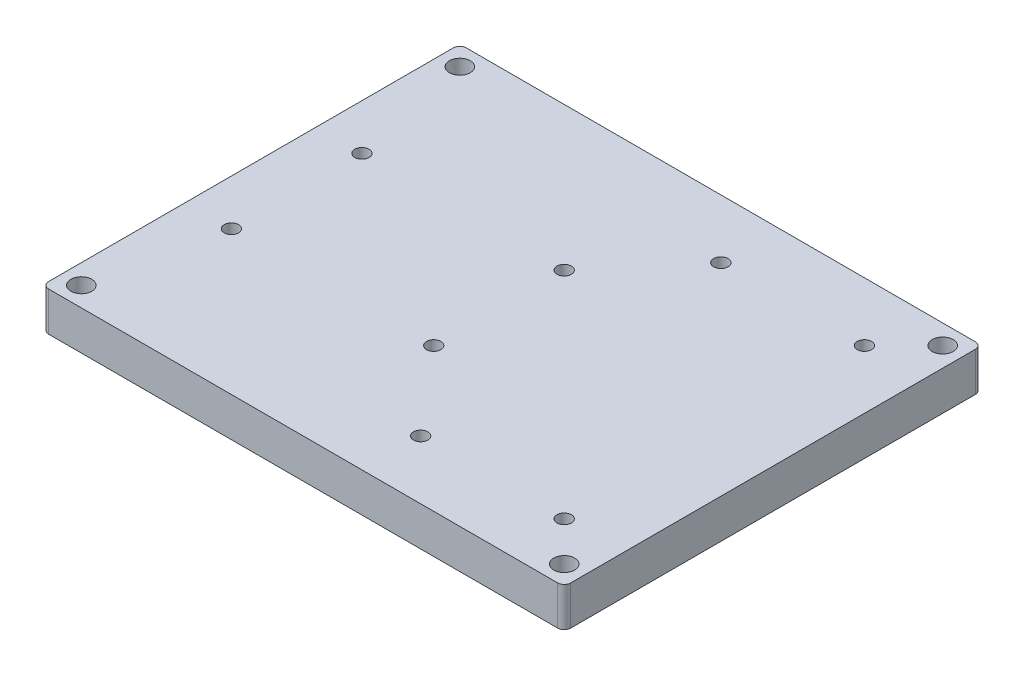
ISO-10303-21;
HEADER;
FILE_DESCRIPTION(('STEP AP214'),'2;1');
FILE_NAME('part.step','',(''),(''),'','','');
FILE_SCHEMA(('AUTOMOTIVE_DESIGN { 1 0 10303 214 1 1 1 1 }'));
ENDSEC;
DATA;
#1=APPLICATION_CONTEXT('core data for automotive mechanical design processes');
#2=APPLICATION_PROTOCOL_DEFINITION('international standard','automotive_design',2000,#1);
#3=PRODUCT_CONTEXT('',#1,'mechanical');
#4=PRODUCT('Part','Part','',(#3));
#5=PRODUCT_RELATED_PRODUCT_CATEGORY('part','',(#4));
#6=PRODUCT_DEFINITION_FORMATION('','',#4);
#7=PRODUCT_DEFINITION_CONTEXT('part definition',#1,'design');
#8=PRODUCT_DEFINITION('design','',#6,#7);
#9=PRODUCT_DEFINITION_SHAPE('','',#8);
#10=(LENGTH_UNIT() NAMED_UNIT(*) SI_UNIT(.MILLI.,.METRE.));
#11=(NAMED_UNIT(*) PLANE_ANGLE_UNIT() SI_UNIT($,.RADIAN.));
#12=(NAMED_UNIT(*) SI_UNIT($,.STERADIAN.) SOLID_ANGLE_UNIT());
#13=UNCERTAINTY_MEASURE_WITH_UNIT(LENGTH_MEASURE(1.E-05),#10,'distance_accuracy_value','');
#14=(GEOMETRIC_REPRESENTATION_CONTEXT(3) GLOBAL_UNCERTAINTY_ASSIGNED_CONTEXT((#13)) GLOBAL_UNIT_ASSIGNED_CONTEXT((#10,
#11,#12)) REPRESENTATION_CONTEXT('',''));
#15=CARTESIAN_POINT('',(0.,0.,0.));
#16=DIRECTION('',(0.,0.,1.));
#17=DIRECTION('',(1.,0.,0.));
#18=AXIS2_PLACEMENT_3D('',#15,#16,#17);
#19=CARTESIAN_POINT('',(79.,6.,-1.));
#20=DIRECTION('',(0.,1.,0.));
#21=DIRECTION('',(0.,0.,1.));
#22=AXIS2_PLACEMENT_3D('',#19,#20,#21);
#23=PLANE('',#22);
#24=CARTESIAN_POINT('',(7.00000000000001,6.,-42.));
#25=DIRECTION('',(0.,1.,0.));
#26=DIRECTION('',(0.,0.,-1.));
#27=AXIS2_PLACEMENT_3D('',#24,#25,#26);
#28=CIRCLE('',#27,1.1);
#29=CARTESIAN_POINT('',(7.00000000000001,6.,-43.1));
#30=VERTEX_POINT('',#29);
#31=EDGE_CURVE('E234',#30,#30,#28,.T.);
#32=ORIENTED_EDGE('',*,*,#31,.F.);
#33=EDGE_LOOP('',(#32));
#34=FACE_BOUND('',#33,.T.);
#35=CARTESIAN_POINT('',(49.,6.,-55.));
#36=DIRECTION('',(0.,1.,0.));
#37=DIRECTION('',(0.,0.,-1.));
#38=AXIS2_PLACEMENT_3D('',#35,#36,#37);
#39=CIRCLE('',#38,1.1);
#40=CARTESIAN_POINT('',(49.,6.,-56.1));
#41=VERTEX_POINT('',#40);
#42=EDGE_CURVE('E222',#41,#41,#39,.T.);
#43=ORIENTED_EDGE('',*,*,#42,.F.);
#44=EDGE_LOOP('',(#43));
#45=FACE_BOUND('',#44,.T.);
#46=CARTESIAN_POINT('',(77.,6.,-61.));
#47=DIRECTION('',(0.,1.,0.));
#48=DIRECTION('',(0.,0.,-1.));
#49=AXIS2_PLACEMENT_3D('',#46,#47,#48);
#50=CIRCLE('',#49,1.6);
#51=CARTESIAN_POINT('',(77.,6.,-62.6));
#52=VERTEX_POINT('',#51);
#53=EDGE_CURVE('E210',#52,#52,#50,.T.);
#54=ORIENTED_EDGE('',*,*,#53,.F.);
#55=EDGE_LOOP('',(#54));
#56=FACE_BOUND('',#55,.T.);
#57=CARTESIAN_POINT('',(77.,6.,-3.));
#58=DIRECTION('',(0.,1.,0.));
#59=DIRECTION('',(0.,0.,1.));
#60=AXIS2_PLACEMENT_3D('',#57,#58,#59);
#61=CIRCLE('',#60,1.60000000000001);
#62=CARTESIAN_POINT('',(77.,6.,-1.39999999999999));
#63=VERTEX_POINT('',#62);
#64=EDGE_CURVE('E198',#63,#63,#61,.T.);
#65=ORIENTED_EDGE('',*,*,#64,.F.);
#66=EDGE_LOOP('',(#65));
#67=FACE_BOUND('',#66,.T.);
#68=CARTESIAN_POINT('',(38.,6.,-22.));
#69=DIRECTION('',(0.,1.,0.));
#70=DIRECTION('',(0.,0.,1.));
#71=AXIS2_PLACEMENT_3D('',#68,#69,#70);
#72=CIRCLE('',#71,1.1);
#73=CARTESIAN_POINT('',(38.,6.,-20.9));
#74=VERTEX_POINT('',#73);
#75=EDGE_CURVE('E186',#74,#74,#72,.T.);
#76=ORIENTED_EDGE('',*,*,#75,.F.);
#77=EDGE_LOOP('',(#76));
#78=FACE_BOUND('',#77,.T.);
#79=CARTESIAN_POINT('',(71.,6.,-9.));
#80=DIRECTION('',(0.,1.,0.));
#81=DIRECTION('',(0.,0.,1.));
#82=AXIS2_PLACEMENT_3D('',#79,#80,#81);
#83=CIRCLE('',#82,1.10000000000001);
#84=CARTESIAN_POINT('',(71.,6.,-7.89999999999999));
#85=VERTEX_POINT('',#84);
#86=EDGE_CURVE('E132',#85,#85,#83,.T.);
#87=ORIENTED_EDGE('',*,*,#86,.F.);
#88=EDGE_LOOP('',(#87));
#89=FACE_BOUND('',#88,.T.);
#90=CARTESIAN_POINT('',(79.,6.,-1.));
#91=DIRECTION('',(0.,1.,0.));
#92=DIRECTION('',(0.,0.,1.));
#93=AXIS2_PLACEMENT_3D('',#90,#91,#92);
#94=CIRCLE('',#93,1.);
#95=CARTESIAN_POINT('',(79.,6.,0.));
#96=VERTEX_POINT('',#95);
#97=CARTESIAN_POINT('',(80.,6.,-1.00000000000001));
#98=VERTEX_POINT('',#97);
#99=EDGE_CURVE('E143',#96,#98,#94,.T.);
#100=ORIENTED_EDGE('',*,*,#99,.T.);
#101=DIRECTION('',(0.,0.,-1.));
#102=VECTOR('',#101,1.);
#103=CARTESIAN_POINT('',(80.,6.,-1.00000000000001));
#104=LINE('',#103,#102);
#105=CARTESIAN_POINT('',(80.,6.,-63.));
#106=VERTEX_POINT('',#105);
#107=EDGE_CURVE('E91',#98,#106,#104,.T.);
#108=ORIENTED_EDGE('',*,*,#107,.T.);
#109=CARTESIAN_POINT('',(79.,6.,-63.));
#110=DIRECTION('',(0.,1.,0.));
#111=DIRECTION('',(0.,0.,-1.));
#112=AXIS2_PLACEMENT_3D('',#109,#110,#111);
#113=CIRCLE('',#112,1.);
#114=CARTESIAN_POINT('',(79.,6.,-64.));
#115=VERTEX_POINT('',#114);
#116=EDGE_CURVE('E158',#106,#115,#113,.T.);
#117=ORIENTED_EDGE('',*,*,#116,.T.);
#118=DIRECTION('',(-1.,0.,0.));
#119=VECTOR('',#118,1.);
#120=CARTESIAN_POINT('',(1.00000000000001,6.,-64.));
#121=LINE('',#120,#119);
#122=CARTESIAN_POINT('',(1.00000000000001,6.,-64.));
#123=VERTEX_POINT('',#122);
#124=EDGE_CURVE('E171',#115,#123,#121,.T.);
#125=ORIENTED_EDGE('',*,*,#124,.T.);
#126=CARTESIAN_POINT('',(1.,6.,-63.));
#127=DIRECTION('',(0.,1.,0.));
#128=DIRECTION('',(0.,0.,-1.));
#129=AXIS2_PLACEMENT_3D('',#126,#127,#128);
#130=CIRCLE('',#129,1.);
#131=CARTESIAN_POINT('',(0.,6.,-63.));
#132=VERTEX_POINT('',#131);
#133=EDGE_CURVE('E110',#123,#132,#130,.T.);
#134=ORIENTED_EDGE('',*,*,#133,.T.);
#135=DIRECTION('',(0.,0.,1.));
#136=VECTOR('',#135,1.);
#137=CARTESIAN_POINT('',(0.,6.,-1.00000000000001));
#138=LINE('',#137,#136);
#139=CARTESIAN_POINT('',(0.,6.,-1.00000000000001));
#140=VERTEX_POINT('',#139);
#141=EDGE_CURVE('E104',#132,#140,#138,.T.);
#142=ORIENTED_EDGE('',*,*,#141,.T.);
#143=CARTESIAN_POINT('',(1.,6.,-1.));
#144=DIRECTION('',(0.,1.,0.));
#145=DIRECTION('',(0.,0.,-1.));
#146=AXIS2_PLACEMENT_3D('',#143,#144,#145);
#147=CIRCLE('',#146,1.);
#148=CARTESIAN_POINT('',(1.00000000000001,6.,0.));
#149=VERTEX_POINT('',#148);
#150=EDGE_CURVE('E108',#140,#149,#147,.T.);
#151=ORIENTED_EDGE('',*,*,#150,.T.);
#152=DIRECTION('',(1.,0.,0.));
#153=VECTOR('',#152,1.);
#154=CARTESIAN_POINT('',(1.00000000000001,6.,0.));
#155=LINE('',#154,#153);
#156=EDGE_CURVE('E48',#149,#96,#155,.T.);
#157=ORIENTED_EDGE('',*,*,#156,.T.);
#158=EDGE_LOOP('',(#100,#108,#117,#125,#134,#142,#151,#157));
#159=FACE_BOUND('',#158,.T.);
#160=CARTESIAN_POINT('',(49.,6.,-9.));
#161=DIRECTION('',(0.,1.,0.));
#162=DIRECTION('',(0.,0.,1.));
#163=AXIS2_PLACEMENT_3D('',#160,#161,#162);
#164=CIRCLE('',#163,1.1);
#165=CARTESIAN_POINT('',(49.,6.,-7.9));
#166=VERTEX_POINT('',#165);
#167=EDGE_CURVE('E180',#166,#166,#164,.T.);
#168=ORIENTED_EDGE('',*,*,#167,.F.);
#169=EDGE_LOOP('',(#168));
#170=FACE_BOUND('',#169,.T.);
#171=CARTESIAN_POINT('',(7.00000000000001,6.,-22.));
#172=DIRECTION('',(0.,1.,0.));
#173=DIRECTION('',(0.,0.,1.));
#174=AXIS2_PLACEMENT_3D('',#171,#172,#173);
#175=CIRCLE('',#174,1.1);
#176=CARTESIAN_POINT('',(7.00000000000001,6.,-20.9));
#177=VERTEX_POINT('',#176);
#178=EDGE_CURVE('E192',#177,#177,#175,.T.);
#179=ORIENTED_EDGE('',*,*,#178,.F.);
#180=EDGE_LOOP('',(#179));
#181=FACE_BOUND('',#180,.T.);
#182=CARTESIAN_POINT('',(3.,6.,-3.));
#183=DIRECTION('',(0.,1.,0.));
#184=DIRECTION('',(0.,0.,1.));
#185=AXIS2_PLACEMENT_3D('',#182,#183,#184);
#186=CIRCLE('',#185,1.6);
#187=CARTESIAN_POINT('',(3.,6.,-1.4));
#188=VERTEX_POINT('',#187);
#189=EDGE_CURVE('E204',#188,#188,#186,.T.);
#190=ORIENTED_EDGE('',*,*,#189,.F.);
#191=EDGE_LOOP('',(#190));
#192=FACE_BOUND('',#191,.T.);
#193=CARTESIAN_POINT('',(71.,6.,-55.));
#194=DIRECTION('',(0.,1.,0.));
#195=DIRECTION('',(0.,0.,-1.));
#196=AXIS2_PLACEMENT_3D('',#193,#194,#195);
#197=CIRCLE('',#196,1.1);
#198=CARTESIAN_POINT('',(71.,6.,-56.1));
#199=VERTEX_POINT('',#198);
#200=EDGE_CURVE('E216',#199,#199,#197,.T.);
#201=ORIENTED_EDGE('',*,*,#200,.F.);
#202=EDGE_LOOP('',(#201));
#203=FACE_BOUND('',#202,.T.);
#204=CARTESIAN_POINT('',(38.,6.,-42.));
#205=DIRECTION('',(0.,1.,0.));
#206=DIRECTION('',(0.,0.,-1.));
#207=AXIS2_PLACEMENT_3D('',#204,#205,#206);
#208=CIRCLE('',#207,1.1);
#209=CARTESIAN_POINT('',(38.,6.,-43.1));
#210=VERTEX_POINT('',#209);
#211=EDGE_CURVE('E228',#210,#210,#208,.T.);
#212=ORIENTED_EDGE('',*,*,#211,.F.);
#213=EDGE_LOOP('',(#212));
#214=FACE_BOUND('',#213,.T.);
#215=CARTESIAN_POINT('',(3.,6.,-61.));
#216=DIRECTION('',(0.,1.,0.));
#217=DIRECTION('',(0.,0.,-1.));
#218=AXIS2_PLACEMENT_3D('',#215,#216,#217);
#219=CIRCLE('',#218,1.6);
#220=CARTESIAN_POINT('',(3.,6.,-62.6));
#221=VERTEX_POINT('',#220);
#222=EDGE_CURVE('E240',#221,#221,#219,.T.);
#223=ORIENTED_EDGE('',*,*,#222,.F.);
#224=EDGE_LOOP('',(#223));
#225=FACE_BOUND('',#224,.T.);
#226=ADVANCED_FACE('F31',(#34,#45,#56,#67,#78,#89,#159,#170,#181,#192,#203,#214,#225),#23,.T.);
#227=CARTESIAN_POINT('',(79.,0.,-1.));
#228=DIRECTION('',(0.,1.,0.));
#229=DIRECTION('',(0.,0.,1.));
#230=AXIS2_PLACEMENT_3D('',#227,#228,#229);
#231=PLANE('',#230);
#232=CARTESIAN_POINT('',(7.00000000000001,0.,-42.));
#233=DIRECTION('',(0.,1.,0.));
#234=DIRECTION('',(0.,0.,-1.));
#235=AXIS2_PLACEMENT_3D('',#232,#233,#234);
#236=CIRCLE('',#235,1.1);
#237=CARTESIAN_POINT('',(7.00000000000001,0.,-43.1));
#238=VERTEX_POINT('',#237);
#239=EDGE_CURVE('E237',#238,#238,#236,.T.);
#240=ORIENTED_EDGE('',*,*,#239,.T.);
#241=EDGE_LOOP('',(#240));
#242=FACE_BOUND('',#241,.T.);
#243=CARTESIAN_POINT('',(49.,0.,-55.));
#244=DIRECTION('',(0.,1.,0.));
#245=DIRECTION('',(0.,0.,-1.));
#246=AXIS2_PLACEMENT_3D('',#243,#244,#245);
#247=CIRCLE('',#246,1.1);
#248=CARTESIAN_POINT('',(49.,0.,-56.1));
#249=VERTEX_POINT('',#248);
#250=EDGE_CURVE('E225',#249,#249,#247,.T.);
#251=ORIENTED_EDGE('',*,*,#250,.T.);
#252=EDGE_LOOP('',(#251));
#253=FACE_BOUND('',#252,.T.);
#254=CARTESIAN_POINT('',(77.,0.,-61.));
#255=DIRECTION('',(0.,1.,0.));
#256=DIRECTION('',(0.,0.,-1.));
#257=AXIS2_PLACEMENT_3D('',#254,#255,#256);
#258=CIRCLE('',#257,1.6);
#259=CARTESIAN_POINT('',(77.,0.,-62.6));
#260=VERTEX_POINT('',#259);
#261=EDGE_CURVE('E213',#260,#260,#258,.T.);
#262=ORIENTED_EDGE('',*,*,#261,.T.);
#263=EDGE_LOOP('',(#262));
#264=FACE_BOUND('',#263,.T.);
#265=CARTESIAN_POINT('',(77.,0.,-3.));
#266=DIRECTION('',(0.,1.,0.));
#267=DIRECTION('',(0.,0.,1.));
#268=AXIS2_PLACEMENT_3D('',#265,#266,#267);
#269=CIRCLE('',#268,1.60000000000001);
#270=CARTESIAN_POINT('',(77.,0.,-1.39999999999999));
#271=VERTEX_POINT('',#270);
#272=EDGE_CURVE('E201',#271,#271,#269,.T.);
#273=ORIENTED_EDGE('',*,*,#272,.T.);
#274=EDGE_LOOP('',(#273));
#275=FACE_BOUND('',#274,.T.);
#276=CARTESIAN_POINT('',(38.,0.,-22.));
#277=DIRECTION('',(0.,1.,0.));
#278=DIRECTION('',(0.,0.,1.));
#279=AXIS2_PLACEMENT_3D('',#276,#277,#278);
#280=CIRCLE('',#279,1.1);
#281=CARTESIAN_POINT('',(38.,0.,-20.9));
#282=VERTEX_POINT('',#281);
#283=EDGE_CURVE('E189',#282,#282,#280,.T.);
#284=ORIENTED_EDGE('',*,*,#283,.T.);
#285=EDGE_LOOP('',(#284));
#286=FACE_BOUND('',#285,.T.);
#287=CARTESIAN_POINT('',(71.,0.,-9.));
#288=DIRECTION('',(0.,1.,0.));
#289=DIRECTION('',(0.,0.,1.));
#290=AXIS2_PLACEMENT_3D('',#287,#288,#289);
#291=CIRCLE('',#290,1.10000000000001);
#292=CARTESIAN_POINT('',(71.,0.,-7.89999999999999));
#293=VERTEX_POINT('',#292);
#294=EDGE_CURVE('E177',#293,#293,#291,.T.);
#295=ORIENTED_EDGE('',*,*,#294,.T.);
#296=EDGE_LOOP('',(#295));
#297=FACE_BOUND('',#296,.T.);
#298=CARTESIAN_POINT('',(79.,0.,-1.));
#299=DIRECTION('',(0.,1.,0.));
#300=DIRECTION('',(0.,0.,1.));
#301=AXIS2_PLACEMENT_3D('',#298,#299,#300);
#302=CIRCLE('',#301,1.);
#303=CARTESIAN_POINT('',(79.,0.,0.));
#304=VERTEX_POINT('',#303);
#305=CARTESIAN_POINT('',(80.,0.,-1.00000000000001));
#306=VERTEX_POINT('',#305);
#307=EDGE_CURVE('E128',#304,#306,#302,.T.);
#308=ORIENTED_EDGE('',*,*,#307,.F.);
#309=DIRECTION('',(1.,0.,0.));
#310=VECTOR('',#309,1.);
#311=CARTESIAN_POINT('',(1.00000000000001,0.,0.));
#312=LINE('',#311,#310);
#313=CARTESIAN_POINT('',(1.00000000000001,0.,0.));
#314=VERTEX_POINT('',#313);
#315=EDGE_CURVE('E83',#314,#304,#312,.T.);
#316=ORIENTED_EDGE('',*,*,#315,.F.);
#317=CARTESIAN_POINT('',(1.,0.,-1.));
#318=DIRECTION('',(0.,1.,0.));
#319=DIRECTION('',(0.,0.,-1.));
#320=AXIS2_PLACEMENT_3D('',#317,#318,#319);
#321=CIRCLE('',#320,1.);
#322=CARTESIAN_POINT('',(0.,0.,-1.00000000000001));
#323=VERTEX_POINT('',#322);
#324=EDGE_CURVE('E77',#323,#314,#321,.T.);
#325=ORIENTED_EDGE('',*,*,#324,.F.);
#326=DIRECTION('',(0.,0.,1.));
#327=VECTOR('',#326,1.);
#328=CARTESIAN_POINT('',(0.,0.,-1.00000000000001));
#329=LINE('',#328,#327);
#330=CARTESIAN_POINT('',(0.,0.,-63.));
#331=VERTEX_POINT('',#330);
#332=EDGE_CURVE('E118',#331,#323,#329,.T.);
#333=ORIENTED_EDGE('',*,*,#332,.F.);
#334=CARTESIAN_POINT('',(1.,0.,-63.));
#335=DIRECTION('',(0.,1.,0.));
#336=DIRECTION('',(0.,0.,-1.));
#337=AXIS2_PLACEMENT_3D('',#334,#335,#336);
#338=CIRCLE('',#337,1.);
#339=CARTESIAN_POINT('',(1.00000000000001,0.,-64.));
#340=VERTEX_POINT('',#339);
#341=EDGE_CURVE('E138',#340,#331,#338,.T.);
#342=ORIENTED_EDGE('',*,*,#341,.F.);
#343=DIRECTION('',(-1.,0.,0.));
#344=VECTOR('',#343,1.);
#345=CARTESIAN_POINT('',(1.00000000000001,0.,-64.));
#346=LINE('',#345,#344);
#347=CARTESIAN_POINT('',(79.,0.,-64.));
#348=VERTEX_POINT('',#347);
#349=EDGE_CURVE('E136',#348,#340,#346,.T.);
#350=ORIENTED_EDGE('',*,*,#349,.F.);
#351=CARTESIAN_POINT('',(79.,0.,-63.));
#352=DIRECTION('',(0.,1.,0.));
#353=DIRECTION('',(0.,0.,-1.));
#354=AXIS2_PLACEMENT_3D('',#351,#352,#353);
#355=CIRCLE('',#354,1.);
#356=CARTESIAN_POINT('',(80.,0.,-63.));
#357=VERTEX_POINT('',#356);
#358=EDGE_CURVE('E134',#357,#348,#355,.T.);
#359=ORIENTED_EDGE('',*,*,#358,.F.);
#360=DIRECTION('',(0.,0.,-1.));
#361=VECTOR('',#360,1.);
#362=CARTESIAN_POINT('',(80.,0.,-1.00000000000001));
#363=LINE('',#362,#361);
#364=EDGE_CURVE('E131',#306,#357,#363,.T.);
#365=ORIENTED_EDGE('',*,*,#364,.F.);
#366=EDGE_LOOP('',(#308,#316,#325,#333,#342,#350,#359,#365));
#367=FACE_BOUND('',#366,.T.);
#368=CARTESIAN_POINT('',(49.,0.,-9.));
#369=DIRECTION('',(0.,1.,0.));
#370=DIRECTION('',(0.,0.,1.));
#371=AXIS2_PLACEMENT_3D('',#368,#369,#370);
#372=CIRCLE('',#371,1.1);
#373=CARTESIAN_POINT('',(49.,0.,-7.9));
#374=VERTEX_POINT('',#373);
#375=EDGE_CURVE('E183',#374,#374,#372,.T.);
#376=ORIENTED_EDGE('',*,*,#375,.T.);
#377=EDGE_LOOP('',(#376));
#378=FACE_BOUND('',#377,.T.);
#379=CARTESIAN_POINT('',(7.00000000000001,0.,-22.));
#380=DIRECTION('',(0.,1.,0.));
#381=DIRECTION('',(0.,0.,1.));
#382=AXIS2_PLACEMENT_3D('',#379,#380,#381);
#383=CIRCLE('',#382,1.1);
#384=CARTESIAN_POINT('',(7.00000000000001,0.,-20.9));
#385=VERTEX_POINT('',#384);
#386=EDGE_CURVE('E195',#385,#385,#383,.T.);
#387=ORIENTED_EDGE('',*,*,#386,.T.);
#388=EDGE_LOOP('',(#387));
#389=FACE_BOUND('',#388,.T.);
#390=CARTESIAN_POINT('',(3.,0.,-3.));
#391=DIRECTION('',(0.,1.,0.));
#392=DIRECTION('',(0.,0.,1.));
#393=AXIS2_PLACEMENT_3D('',#390,#391,#392);
#394=CIRCLE('',#393,1.6);
#395=CARTESIAN_POINT('',(3.,0.,-1.4));
#396=VERTEX_POINT('',#395);
#397=EDGE_CURVE('E207',#396,#396,#394,.T.);
#398=ORIENTED_EDGE('',*,*,#397,.T.);
#399=EDGE_LOOP('',(#398));
#400=FACE_BOUND('',#399,.T.);
#401=CARTESIAN_POINT('',(71.,0.,-55.));
#402=DIRECTION('',(0.,1.,0.));
#403=DIRECTION('',(0.,0.,-1.));
#404=AXIS2_PLACEMENT_3D('',#401,#402,#403);
#405=CIRCLE('',#404,1.1);
#406=CARTESIAN_POINT('',(71.,0.,-56.1));
#407=VERTEX_POINT('',#406);
#408=EDGE_CURVE('E219',#407,#407,#405,.T.);
#409=ORIENTED_EDGE('',*,*,#408,.T.);
#410=EDGE_LOOP('',(#409));
#411=FACE_BOUND('',#410,.T.);
#412=CARTESIAN_POINT('',(38.,0.,-42.));
#413=DIRECTION('',(0.,1.,0.));
#414=DIRECTION('',(0.,0.,-1.));
#415=AXIS2_PLACEMENT_3D('',#412,#413,#414);
#416=CIRCLE('',#415,1.1);
#417=CARTESIAN_POINT('',(38.,0.,-43.1));
#418=VERTEX_POINT('',#417);
#419=EDGE_CURVE('E231',#418,#418,#416,.T.);
#420=ORIENTED_EDGE('',*,*,#419,.T.);
#421=EDGE_LOOP('',(#420));
#422=FACE_BOUND('',#421,.T.);
#423=CARTESIAN_POINT('',(3.,0.,-61.));
#424=DIRECTION('',(0.,1.,0.));
#425=DIRECTION('',(0.,0.,-1.));
#426=AXIS2_PLACEMENT_3D('',#423,#424,#425);
#427=CIRCLE('',#426,1.6);
#428=CARTESIAN_POINT('',(3.,0.,-62.6));
#429=VERTEX_POINT('',#428);
#430=EDGE_CURVE('E243',#429,#429,#427,.T.);
#431=ORIENTED_EDGE('',*,*,#430,.T.);
#432=EDGE_LOOP('',(#431));
#433=FACE_BOUND('',#432,.T.);
#434=ADVANCED_FACE('F162',(#242,#253,#264,#275,#286,#297,#367,#378,#389,#400,#411,#422,#433),
#231,.F.);
#435=CARTESIAN_POINT('',(79.,6.,-1.));
#436=DIRECTION('',(0.,-1.,0.));
#437=DIRECTION('',(0.,0.,-1.));
#438=AXIS2_PLACEMENT_3D('',#435,#436,#437);
#439=CYLINDRICAL_SURFACE('',#438,1.);
#440=ORIENTED_EDGE('',*,*,#307,.T.);
#441=DIRECTION('',(0.,-1.,0.));
#442=VECTOR('',#441,1.);
#443=CARTESIAN_POINT('',(80.,6.,-1.00000000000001));
#444=LINE('',#443,#442);
#445=EDGE_CURVE('E11',#98,#306,#444,.T.);
#446=ORIENTED_EDGE('',*,*,#445,.F.);
#447=ORIENTED_EDGE('',*,*,#99,.F.);
#448=DIRECTION('',(0.,-1.,0.));
#449=VECTOR('',#448,1.);
#450=CARTESIAN_POINT('',(79.,6.,0.));
#451=LINE('',#450,#449);
#452=EDGE_CURVE('E124',#96,#304,#451,.T.);
#453=ORIENTED_EDGE('',*,*,#452,.T.);
#454=EDGE_LOOP('',(#440,#446,#447,#453));
#455=FACE_BOUND('',#454,.T.);
#456=ADVANCED_FACE('F33',(#455),#439,.T.);
#457=CARTESIAN_POINT('',(80.,6.,-1.00000000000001));
#458=DIRECTION('',(-1.,0.,0.));
#459=DIRECTION('',(0.,0.,1.));
#460=AXIS2_PLACEMENT_3D('',#457,#458,#459);
#461=PLANE('',#460);
#462=ORIENTED_EDGE('',*,*,#364,.T.);
#463=DIRECTION('',(0.,-1.,0.));
#464=VECTOR('',#463,1.);
#465=CARTESIAN_POINT('',(80.,6.,-63.));
#466=LINE('',#465,#464);
#467=EDGE_CURVE('E40',#106,#357,#466,.T.);
#468=ORIENTED_EDGE('',*,*,#467,.F.);
#469=ORIENTED_EDGE('',*,*,#107,.F.);
#470=ORIENTED_EDGE('',*,*,#445,.T.);
#471=EDGE_LOOP('',(#462,#468,#469,#470));
#472=FACE_BOUND('',#471,.T.);
#473=ADVANCED_FACE('F278',(#472),#461,.F.);
#474=CARTESIAN_POINT('',(79.,6.,-63.));
#475=DIRECTION('',(0.,-1.,0.));
#476=DIRECTION('',(0.,0.,-1.));
#477=AXIS2_PLACEMENT_3D('',#474,#475,#476);
#478=CYLINDRICAL_SURFACE('',#477,1.);
#479=ORIENTED_EDGE('',*,*,#358,.T.);
#480=DIRECTION('',(0.,-1.,0.));
#481=VECTOR('',#480,1.);
#482=CARTESIAN_POINT('',(79.,6.,-64.));
#483=LINE('',#482,#481);
#484=EDGE_CURVE('E150',#115,#348,#483,.T.);
#485=ORIENTED_EDGE('',*,*,#484,.F.);
#486=ORIENTED_EDGE('',*,*,#116,.F.);
#487=ORIENTED_EDGE('',*,*,#467,.T.);
#488=EDGE_LOOP('',(#479,#485,#486,#487));
#489=FACE_BOUND('',#488,.T.);
#490=ADVANCED_FACE('F156',(#489),#478,.T.);
#491=CARTESIAN_POINT('',(1.00000000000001,6.,-64.));
#492=DIRECTION('',(0.,0.,1.));
#493=DIRECTION('',(1.,0.,0.));
#494=AXIS2_PLACEMENT_3D('',#491,#492,#493);
#495=PLANE('',#494);
#496=ORIENTED_EDGE('',*,*,#349,.T.);
#497=DIRECTION('',(0.,-1.,0.));
#498=VECTOR('',#497,1.);
#499=CARTESIAN_POINT('',(1.00000000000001,6.,-64.));
#500=LINE('',#499,#498);
#501=EDGE_CURVE('E147',#123,#340,#500,.T.);
#502=ORIENTED_EDGE('',*,*,#501,.F.);
#503=ORIENTED_EDGE('',*,*,#124,.F.);
#504=ORIENTED_EDGE('',*,*,#484,.T.);
#505=EDGE_LOOP('',(#496,#502,#503,#504));
#506=FACE_BOUND('',#505,.T.);
#507=ADVANCED_FACE('F167',(#506),#495,.F.);
#508=CARTESIAN_POINT('',(1.,6.,-63.));
#509=DIRECTION('',(0.,-1.,0.));
#510=DIRECTION('',(0.,0.,-1.));
#511=AXIS2_PLACEMENT_3D('',#508,#509,#510);
#512=CYLINDRICAL_SURFACE('',#511,1.);
#513=ORIENTED_EDGE('',*,*,#341,.T.);
#514=DIRECTION('',(0.,-1.,0.));
#515=VECTOR('',#514,1.);
#516=CARTESIAN_POINT('',(0.,6.,-63.));
#517=LINE('',#516,#515);
#518=EDGE_CURVE('E119',#132,#331,#517,.T.);
#519=ORIENTED_EDGE('',*,*,#518,.F.);
#520=ORIENTED_EDGE('',*,*,#133,.F.);
#521=ORIENTED_EDGE('',*,*,#501,.T.);
#522=EDGE_LOOP('',(#513,#519,#520,#521));
#523=FACE_BOUND('',#522,.T.);
#524=ADVANCED_FACE('F170',(#523),#512,.T.);
#525=CARTESIAN_POINT('',(0.,6.,-1.00000000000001));
#526=DIRECTION('',(1.,0.,0.));
#527=DIRECTION('',(0.,0.,-1.));
#528=AXIS2_PLACEMENT_3D('',#525,#526,#527);
#529=PLANE('',#528);
#530=ORIENTED_EDGE('',*,*,#332,.T.);
#531=DIRECTION('',(0.,-1.,0.));
#532=VECTOR('',#531,1.);
#533=CARTESIAN_POINT('',(0.,6.,-1.00000000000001));
#534=LINE('',#533,#532);
#535=EDGE_CURVE('E115',#140,#323,#534,.T.);
#536=ORIENTED_EDGE('',*,*,#535,.F.);
#537=ORIENTED_EDGE('',*,*,#141,.F.);
#538=ORIENTED_EDGE('',*,*,#518,.T.);
#539=EDGE_LOOP('',(#530,#536,#537,#538));
#540=FACE_BOUND('',#539,.T.);
#541=ADVANCED_FACE('F116',(#540),#529,.F.);
#542=CARTESIAN_POINT('',(1.,6.,-1.));
#543=DIRECTION('',(0.,-1.,0.));
#544=DIRECTION('',(0.,0.,-1.));
#545=AXIS2_PLACEMENT_3D('',#542,#543,#544);
#546=CYLINDRICAL_SURFACE('',#545,1.);
#547=ORIENTED_EDGE('',*,*,#324,.T.);
#548=DIRECTION('',(0.,-1.,0.));
#549=VECTOR('',#548,1.);
#550=CARTESIAN_POINT('',(1.00000000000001,6.,0.));
#551=LINE('',#550,#549);
#552=EDGE_CURVE('E120',#149,#314,#551,.T.);
#553=ORIENTED_EDGE('',*,*,#552,.F.);
#554=ORIENTED_EDGE('',*,*,#150,.F.);
#555=ORIENTED_EDGE('',*,*,#535,.T.);
#556=EDGE_LOOP('',(#547,#553,#554,#555));
#557=FACE_BOUND('',#556,.T.);
#558=ADVANCED_FACE('F122',(#557),#546,.T.);
#559=CARTESIAN_POINT('',(1.00000000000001,6.,0.));
#560=DIRECTION('',(0.,0.,-1.));
#561=DIRECTION('',(-1.,0.,0.));
#562=AXIS2_PLACEMENT_3D('',#559,#560,#561);
#563=PLANE('',#562);
#564=ORIENTED_EDGE('',*,*,#315,.T.);
#565=ORIENTED_EDGE('',*,*,#452,.F.);
#566=ORIENTED_EDGE('',*,*,#156,.F.);
#567=ORIENTED_EDGE('',*,*,#552,.T.);
#568=EDGE_LOOP('',(#564,#565,#566,#567));
#569=FACE_BOUND('',#568,.T.);
#570=ADVANCED_FACE('F266',(#569),#563,.F.);
#571=CARTESIAN_POINT('',(71.,6.,-9.));
#572=DIRECTION('',(0.,-1.,0.));
#573=DIRECTION('',(0.,0.,-1.));
#574=AXIS2_PLACEMENT_3D('',#571,#572,#573);
#575=CYLINDRICAL_SURFACE('',#574,1.10000000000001);
#576=ORIENTED_EDGE('',*,*,#86,.T.);
#577=EDGE_LOOP('',(#576));
#578=FACE_BOUND('',#577,.T.);
#579=ORIENTED_EDGE('',*,*,#294,.F.);
#580=EDGE_LOOP('',(#579));
#581=FACE_BOUND('',#580,.T.);
#582=ADVANCED_FACE('F263',(#578,#581),#575,.F.);
#583=CARTESIAN_POINT('',(49.,6.,-9.));
#584=DIRECTION('',(0.,-1.,0.));
#585=DIRECTION('',(0.,0.,-1.));
#586=AXIS2_PLACEMENT_3D('',#583,#584,#585);
#587=CYLINDRICAL_SURFACE('',#586,1.1);
#588=ORIENTED_EDGE('',*,*,#167,.T.);
#589=EDGE_LOOP('',(#588));
#590=FACE_BOUND('',#589,.T.);
#591=ORIENTED_EDGE('',*,*,#375,.F.);
#592=EDGE_LOOP('',(#591));
#593=FACE_BOUND('',#592,.T.);
#594=ADVANCED_FACE('F342',(#590,#593),#587,.F.);
#595=CARTESIAN_POINT('',(38.,6.,-22.));
#596=DIRECTION('',(0.,-1.,0.));
#597=DIRECTION('',(0.,0.,-1.));
#598=AXIS2_PLACEMENT_3D('',#595,#596,#597);
#599=CYLINDRICAL_SURFACE('',#598,1.1);
#600=ORIENTED_EDGE('',*,*,#75,.T.);
#601=EDGE_LOOP('',(#600));
#602=FACE_BOUND('',#601,.T.);
#603=ORIENTED_EDGE('',*,*,#283,.F.);
#604=EDGE_LOOP('',(#603));
#605=FACE_BOUND('',#604,.T.);
#606=ADVANCED_FACE('F350',(#602,#605),#599,.F.);
#607=CARTESIAN_POINT('',(7.00000000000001,6.,-22.));
#608=DIRECTION('',(0.,-1.,0.));
#609=DIRECTION('',(0.,0.,-1.));
#610=AXIS2_PLACEMENT_3D('',#607,#608,#609);
#611=CYLINDRICAL_SURFACE('',#610,1.1);
#612=ORIENTED_EDGE('',*,*,#178,.T.);
#613=EDGE_LOOP('',(#612));
#614=FACE_BOUND('',#613,.T.);
#615=ORIENTED_EDGE('',*,*,#386,.F.);
#616=EDGE_LOOP('',(#615));
#617=FACE_BOUND('',#616,.T.);
#618=ADVANCED_FACE('F358',(#614,#617),#611,.F.);
#619=CARTESIAN_POINT('',(77.,6.,-3.));
#620=DIRECTION('',(0.,-1.,0.));
#621=DIRECTION('',(0.,0.,-1.));
#622=AXIS2_PLACEMENT_3D('',#619,#620,#621);
#623=CYLINDRICAL_SURFACE('',#622,1.60000000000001);
#624=ORIENTED_EDGE('',*,*,#64,.T.);
#625=EDGE_LOOP('',(#624));
#626=FACE_BOUND('',#625,.T.);
#627=ORIENTED_EDGE('',*,*,#272,.F.);
#628=EDGE_LOOP('',(#627));
#629=FACE_BOUND('',#628,.T.);
#630=ADVANCED_FACE('F367',(#626,#629),#623,.F.);
#631=CARTESIAN_POINT('',(3.,6.,-3.));
#632=DIRECTION('',(0.,-1.,0.));
#633=DIRECTION('',(0.,0.,-1.));
#634=AXIS2_PLACEMENT_3D('',#631,#632,#633);
#635=CYLINDRICAL_SURFACE('',#634,1.6);
#636=ORIENTED_EDGE('',*,*,#189,.T.);
#637=EDGE_LOOP('',(#636));
#638=FACE_BOUND('',#637,.T.);
#639=ORIENTED_EDGE('',*,*,#397,.F.);
#640=EDGE_LOOP('',(#639));
#641=FACE_BOUND('',#640,.T.);
#642=ADVANCED_FACE('F376',(#638,#641),#635,.F.);
#643=CARTESIAN_POINT('',(77.,6.,-61.));
#644=DIRECTION('',(0.,-1.,0.));
#645=DIRECTION('',(0.,0.,-1.));
#646=AXIS2_PLACEMENT_3D('',#643,#644,#645);
#647=CYLINDRICAL_SURFACE('',#646,1.6);
#648=ORIENTED_EDGE('',*,*,#53,.T.);
#649=EDGE_LOOP('',(#648));
#650=FACE_BOUND('',#649,.T.);
#651=ORIENTED_EDGE('',*,*,#261,.F.);
#652=EDGE_LOOP('',(#651));
#653=FACE_BOUND('',#652,.T.);
#654=ADVANCED_FACE('F385',(#650,#653),#647,.F.);
#655=CARTESIAN_POINT('',(71.,6.,-55.));
#656=DIRECTION('',(0.,-1.,0.));
#657=DIRECTION('',(0.,0.,-1.));
#658=AXIS2_PLACEMENT_3D('',#655,#656,#657);
#659=CYLINDRICAL_SURFACE('',#658,1.1);
#660=ORIENTED_EDGE('',*,*,#200,.T.);
#661=EDGE_LOOP('',(#660));
#662=FACE_BOUND('',#661,.T.);
#663=ORIENTED_EDGE('',*,*,#408,.F.);
#664=EDGE_LOOP('',(#663));
#665=FACE_BOUND('',#664,.T.);
#666=ADVANCED_FACE('F394',(#662,#665),#659,.F.);
#667=CARTESIAN_POINT('',(49.,6.,-55.));
#668=DIRECTION('',(0.,-1.,0.));
#669=DIRECTION('',(0.,0.,-1.));
#670=AXIS2_PLACEMENT_3D('',#667,#668,#669);
#671=CYLINDRICAL_SURFACE('',#670,1.1);
#672=ORIENTED_EDGE('',*,*,#42,.T.);
#673=EDGE_LOOP('',(#672));
#674=FACE_BOUND('',#673,.T.);
#675=ORIENTED_EDGE('',*,*,#250,.F.);
#676=EDGE_LOOP('',(#675));
#677=FACE_BOUND('',#676,.T.);
#678=ADVANCED_FACE('F403',(#674,#677),#671,.F.);
#679=CARTESIAN_POINT('',(38.,6.,-42.));
#680=DIRECTION('',(0.,-1.,0.));
#681=DIRECTION('',(0.,0.,-1.));
#682=AXIS2_PLACEMENT_3D('',#679,#680,#681);
#683=CYLINDRICAL_SURFACE('',#682,1.1);
#684=ORIENTED_EDGE('',*,*,#211,.T.);
#685=EDGE_LOOP('',(#684));
#686=FACE_BOUND('',#685,.T.);
#687=ORIENTED_EDGE('',*,*,#419,.F.);
#688=EDGE_LOOP('',(#687));
#689=FACE_BOUND('',#688,.T.);
#690=ADVANCED_FACE('F412',(#686,#689),#683,.F.);
#691=CARTESIAN_POINT('',(7.00000000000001,6.,-42.));
#692=DIRECTION('',(0.,-1.,0.));
#693=DIRECTION('',(0.,0.,-1.));
#694=AXIS2_PLACEMENT_3D('',#691,#692,#693);
#695=CYLINDRICAL_SURFACE('',#694,1.1);
#696=ORIENTED_EDGE('',*,*,#31,.T.);
#697=EDGE_LOOP('',(#696));
#698=FACE_BOUND('',#697,.T.);
#699=ORIENTED_EDGE('',*,*,#239,.F.);
#700=EDGE_LOOP('',(#699));
#701=FACE_BOUND('',#700,.T.);
#702=ADVANCED_FACE('F421',(#698,#701),#695,.F.);
#703=CARTESIAN_POINT('',(3.,6.,-61.));
#704=DIRECTION('',(0.,-1.,0.));
#705=DIRECTION('',(0.,0.,-1.));
#706=AXIS2_PLACEMENT_3D('',#703,#704,#705);
#707=CYLINDRICAL_SURFACE('',#706,1.6);
#708=ORIENTED_EDGE('',*,*,#222,.T.);
#709=EDGE_LOOP('',(#708));
#710=FACE_BOUND('',#709,.T.);
#711=ORIENTED_EDGE('',*,*,#430,.F.);
#712=EDGE_LOOP('',(#711));
#713=FACE_BOUND('',#712,.T.);
#714=ADVANCED_FACE('F249',(#710,#713),#707,.F.);
#715=CLOSED_SHELL('',(#226,#434,#456,#473,#490,#507,#524,#541,#558,#570,#582,#594,#606,#618,
#630,#642,#654,#666,#678,#690,#702,#714));
#716=MANIFOLD_SOLID_BREP('B2',#715);
#717=ADVANCED_BREP_SHAPE_REPRESENTATION('',(#18,#716),#14);
#718=SHAPE_DEFINITION_REPRESENTATION(#9,#717);
ENDSEC;
END-ISO-10303-21;
